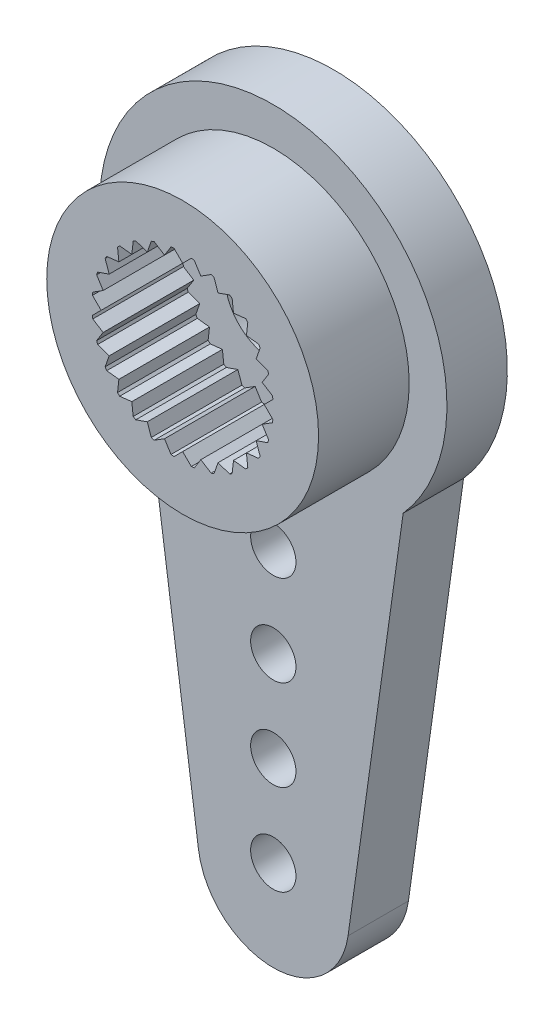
from build123d import *

# Parameters (mm, degrees)
ESQUISSE1_R                  = 5.75
ESQUISSE1_R_2                = 1.6
BOSS_EXTRU_1_DEPTH           = 5
ESQUISSE2_R                  = 3
ENL_V_MAT_EXTRU_1_DEPTH      = 3
ENL_V_START                  = -3
ESQUISSE3_R                  = 5.75
ESQUISSE3_R_2                = 4.5
ENL_V_MAT_EXTRU_2_DEPTH      = 3
BOSS_EXTRU_2_DEPTH           = 2
R_P_TITION_CIRCULAIRE1_COUNT = 2
ESQUISSE5_R                  = 0.75
ENL_V_MAT_EXTRU_3_DEPTH      = 3
R_P_TITION_CIRCULAIRE2_COUNT = 2
BOSS_EXTRU_3_DEPTH           = 3
R_P_TITION_CIRCULAIRE3_COUNT = 28
ENL_V_START_2                = -1
ESQUISSE7_R                  = 3
ESQUISSE7_R_2                = 1.6
ENL_V_MAT_EXTRU_4_DEPTH      = 1
ESQUISSE8_R                  = 4.7
ESQUISSE8_R_2                = 3.4
ENL_V_MAT_EXTRU_5_DEPTH      = 1
SKETCH1_R                    = 0.75
CUT_EXTRUDE1_DEPTH           = 10


with BuildPart() as part:
    # Esquisse1 → Boss.-Extru.1 (new body)
    with BuildSketch(Plane.XY):
        Circle(ESQUISSE1_R)
        Circle(ESQUISSE1_R_2, mode=Mode.SUBTRACT)
    extrude(amount=BOSS_EXTRU_1_DEPTH)

    # Esquisse2 → Enl_v. mat.-Extru.1 (cut)
    with BuildSketch(Plane.XY.offset(5)):
        Circle(ESQUISSE2_R)
    extrude(amount=-ENL_V_MAT_EXTRU_1_DEPTH, mode=Mode.SUBTRACT)

    # Esquisse3 → Enl_v. mat.-Extru.2 (cut)
    with BuildSketch(Plane.XY.offset(5).offset(ENL_V_START)):
        Circle(ESQUISSE3_R)
        Circle(ESQUISSE3_R_2, mode=Mode.SUBTRACT)
    extrude(amount=ENL_V_MAT_EXTRU_2_DEPTH, mode=Mode.SUBTRACT)

    # Esquisse4 → Boss.-Extru.2 (add)
    with BuildSketch(Plane(origin=(0, 0, 0), x_dir=(-1, 0, 0), z_dir=(0, 0, -1))):
        with BuildLine():
            Line((-4.3, 3.817394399), (-2.475852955, 16.846629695))
            ThreePointArc((-2.475852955, 16.846629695), (0, 19), (2.475852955, 16.846629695))
            Line((2.475852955, 16.846629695), (4.3, 3.817394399))
            ThreePointArc((4.3, 3.817394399), (0, 5.75), (-4.3, 3.817394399))
        make_face()
    boss_extru_2 = extrude(amount=-BOSS_EXTRU_2_DEPTH)

    # R_p_tition circulaire1: Boss.-Extru.2 ×2 about axis
    r_p_tition_circulaire1_axis = Axis((0, 0, 0), (0, 0, 1))
    for i in range(1, R_P_TITION_CIRCULAIRE1_COUNT):
        add(boss_extru_2.rotate(r_p_tition_circulaire1_axis, i * 360 / R_P_TITION_CIRCULAIRE1_COUNT))

    # Esquisse5 → Enl_v. mat.-Extru.3 (cut)
    with BuildSketch(Plane(origin=(0, 0, 0), x_dir=(-1, 0, 0), z_dir=(0, 0, -1))):
        with Locations((0, 7)):
            Circle(ESQUISSE5_R)
        with Locations((0, 10)):
            Circle(ESQUISSE5_R)
        with Locations((0, 13)):
            Circle(ESQUISSE5_R)
        with Locations((0, 16)):
            Circle(ESQUISSE5_R)
    enl_v_mat_extru_3 = extrude(amount=-ENL_V_MAT_EXTRU_3_DEPTH, mode=Mode.SUBTRACT)

    # R_p_tition circulaire2: Enl_v. mat.-Extru.3 ×2 about axis
    r_p_tition_circulaire2_axis = Axis((0, 0, 0), (0, 0, 1))
    for i in range(1, R_P_TITION_CIRCULAIRE2_COUNT):
        add(enl_v_mat_extru_3.rotate(r_p_tition_circulaire2_axis, i * 360 / R_P_TITION_CIRCULAIRE2_COUNT), mode=Mode.SUBTRACT)

    # Esquisse6 → Boss.-Extru.3 (add)
    with BuildSketch(Plane.XY.offset(5)):
        Polygon((-0.3, 3), (0, 2.7), (0.3, 3), align=None)
    boss_extru_3 = extrude(amount=-BOSS_EXTRU_3_DEPTH)

    # R_p_tition circulaire3: Boss.-Extru.3 ×28 about axis
    r_p_tition_circulaire3_axis = Axis((0, 0, 0), (0, 0, 1))
    for i in range(1, R_P_TITION_CIRCULAIRE3_COUNT):
        add(boss_extru_3.rotate(r_p_tition_circulaire3_axis, i * 360 / R_P_TITION_CIRCULAIRE3_COUNT))

    # Esquisse7 → Enl_v. mat.-Extru.4 (cut)
    with BuildSketch(Plane(origin=(0, 0, 0), x_dir=(-1, 0, 0), z_dir=(0, 0, -1)).offset(ENL_V_START_2)):
        Circle(ESQUISSE7_R)
        Circle(ESQUISSE7_R_2, mode=Mode.SUBTRACT)
    extrude(amount=ENL_V_MAT_EXTRU_4_DEPTH, mode=Mode.SUBTRACT)

    # Esquisse8 → Enl_v. mat.-Extru.5 (cut)
    with BuildSketch(Plane(origin=(0, 0, 0), x_dir=(-1, 0, 0), z_dir=(0, 0, -1))):
        Circle(ESQUISSE8_R)
        Circle(ESQUISSE8_R_2, mode=Mode.SUBTRACT)
    extrude(amount=-ENL_V_MAT_EXTRU_5_DEPTH, mode=Mode.SUBTRACT)

    # Sketch1 → Cut-Extrude1 (cut)
    with BuildSketch(Plane(origin=(0, 0, 0), x_dir=(-1, 0, 0), z_dir=(0, 0, -1))):
        with BuildLine():
            Line((-2.475852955, 16.846629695), (-4.3, 3.817394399))
            ThreePointArc((-4.3, 3.817394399), (0, 5.75), (4.3, 3.817394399))
            Line((4.3, 3.817394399), (2.475852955, 16.846629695))
            ThreePointArc((2.475852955, 16.846629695), (0, 19), (-2.475852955, 16.846629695))
        make_face()
        with Locations((0, 7)):
            Circle(SKETCH1_R, mode=Mode.SUBTRACT)
        with Locations((0, 10)):
            Circle(SKETCH1_R, mode=Mode.SUBTRACT)
        with Locations((0, 13)):
            Circle(SKETCH1_R, mode=Mode.SUBTRACT)
        with Locations((0, 16)):
            Circle(SKETCH1_R, mode=Mode.SUBTRACT)
    extrude(amount=-CUT_EXTRUDE1_DEPTH, mode=Mode.SUBTRACT)


solid = part.part
